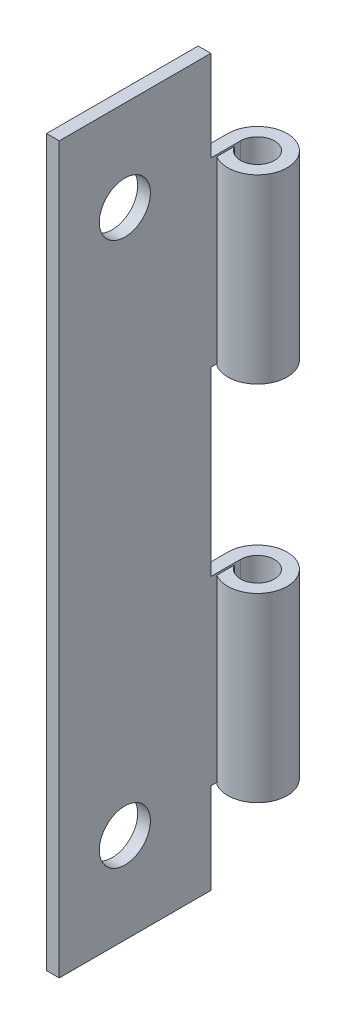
ISO-10303-21;
HEADER;
FILE_DESCRIPTION(('STEP AP214'),'2;1');
FILE_NAME('part.step','',(''),(''),'','','');
FILE_SCHEMA(('AUTOMOTIVE_DESIGN { 1 0 10303 214 1 1 1 1 }'));
ENDSEC;
DATA;
#1=APPLICATION_CONTEXT('core data for automotive mechanical design processes');
#2=APPLICATION_PROTOCOL_DEFINITION('international standard','automotive_design',2000,#1);
#3=PRODUCT_CONTEXT('',#1,'mechanical');
#4=PRODUCT('Part','Part','',(#3));
#5=PRODUCT_RELATED_PRODUCT_CATEGORY('part','',(#4));
#6=PRODUCT_DEFINITION_FORMATION('','',#4);
#7=PRODUCT_DEFINITION_CONTEXT('part definition',#1,'design');
#8=PRODUCT_DEFINITION('design','',#6,#7);
#9=PRODUCT_DEFINITION_SHAPE('','',#8);
#10=(LENGTH_UNIT() NAMED_UNIT(*) SI_UNIT(.MILLI.,.METRE.));
#11=(NAMED_UNIT(*) PLANE_ANGLE_UNIT() SI_UNIT($,.RADIAN.));
#12=(NAMED_UNIT(*) SI_UNIT($,.STERADIAN.) SOLID_ANGLE_UNIT());
#13=UNCERTAINTY_MEASURE_WITH_UNIT(LENGTH_MEASURE(1.E-05),#10,'distance_accuracy_value','');
#14=(GEOMETRIC_REPRESENTATION_CONTEXT(3) GLOBAL_UNCERTAINTY_ASSIGNED_CONTEXT((#13)) GLOBAL_UNIT_ASSIGNED_CONTEXT((#10,
#11,#12)) REPRESENTATION_CONTEXT('',''));
#15=CARTESIAN_POINT('',(0.,0.,0.));
#16=DIRECTION('',(0.,0.,1.));
#17=DIRECTION('',(1.,0.,0.));
#18=AXIS2_PLACEMENT_3D('',#15,#16,#17);
#19=CARTESIAN_POINT('',(2.079625,50.8,0.));
#20=DIRECTION('',(0.,-1.,0.));
#21=DIRECTION('',(0.,0.,-1.));
#22=AXIS2_PLACEMENT_3D('',#19,#20,#21);
#23=CYLINDRICAL_SURFACE('',#22,2.079625);
#24=CARTESIAN_POINT('',(2.079625,44.45,0.));
#25=DIRECTION('',(0.,1.,0.));
#26=DIRECTION('',(0.,0.,1.));
#27=AXIS2_PLACEMENT_3D('',#24,#25,#26);
#28=CIRCLE('',#27,2.079625);
#29=CARTESIAN_POINT('',(1.016,44.45,1.78704840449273));
#30=VERTEX_POINT('',#29);
#31=CARTESIAN_POINT('',(0.,44.45,0.));
#32=VERTEX_POINT('',#31);
#33=EDGE_CURVE('E158',#30,#32,#28,.T.);
#34=ORIENTED_EDGE('',*,*,#33,.F.);
#35=DIRECTION('',(0.,-1.,0.));
#36=VECTOR('',#35,1.);
#37=CARTESIAN_POINT('',(1.016,50.8,1.78704840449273));
#38=LINE('',#37,#36);
#39=CARTESIAN_POINT('',(1.016,31.75,1.78704840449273));
#40=VERTEX_POINT('',#39);
#41=EDGE_CURVE('E234',#30,#40,#38,.T.);
#42=ORIENTED_EDGE('',*,*,#41,.T.);
#43=CARTESIAN_POINT('',(2.079625,31.75,0.));
#44=DIRECTION('',(0.,-1.,0.));
#45=DIRECTION('',(0.,0.,-1.));
#46=AXIS2_PLACEMENT_3D('',#43,#44,#45);
#47=CIRCLE('',#46,2.079625);
#48=CARTESIAN_POINT('',(0.,31.75,0.));
#49=VERTEX_POINT('',#48);
#50=EDGE_CURVE('E50',#49,#40,#47,.T.);
#51=ORIENTED_EDGE('',*,*,#50,.F.);
#52=DIRECTION('',(0.,-1.,0.));
#53=VECTOR('',#52,1.);
#54=CARTESIAN_POINT('',(0.,50.8,0.));
#55=LINE('',#54,#53);
#56=EDGE_CURVE('E252',#32,#49,#55,.T.);
#57=ORIENTED_EDGE('',*,*,#56,.F.);
#58=EDGE_LOOP('',(#34,#42,#51,#57));
#59=FACE_BOUND('',#58,.T.);
#60=ADVANCED_FACE('F36',(#59),#23,.T.);
#61=CARTESIAN_POINT('',(1.016,19.05,1.78704840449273));
#62=VERTEX_POINT('',#61);
#63=CARTESIAN_POINT('',(1.016,6.35,1.78704840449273));
#64=VERTEX_POINT('',#63);
#65=EDGE_CURVE('E226',#62,#64,#38,.T.);
#66=ORIENTED_EDGE('',*,*,#65,.T.);
#67=CARTESIAN_POINT('',(2.079625,6.35,0.));
#68=DIRECTION('',(0.,-1.,0.));
#69=DIRECTION('',(0.,0.,-1.));
#70=AXIS2_PLACEMENT_3D('',#67,#68,#69);
#71=CIRCLE('',#70,2.079625);
#72=CARTESIAN_POINT('',(0.,6.35,0.));
#73=VERTEX_POINT('',#72);
#74=EDGE_CURVE('E211',#73,#64,#71,.T.);
#75=ORIENTED_EDGE('',*,*,#74,.F.);
#76=CARTESIAN_POINT('',(0.,19.05,0.));
#77=VERTEX_POINT('',#76);
#78=EDGE_CURVE('E249',#77,#73,#55,.T.);
#79=ORIENTED_EDGE('',*,*,#78,.F.);
#80=CARTESIAN_POINT('',(2.079625,19.05,0.));
#81=DIRECTION('',(0.,1.,0.));
#82=DIRECTION('',(0.,0.,1.));
#83=AXIS2_PLACEMENT_3D('',#80,#81,#82);
#84=CIRCLE('',#83,2.079625);
#85=EDGE_CURVE('E205',#62,#77,#84,.T.);
#86=ORIENTED_EDGE('',*,*,#85,.F.);
#87=EDGE_LOOP('',(#66,#75,#79,#86));
#88=FACE_BOUND('',#87,.T.);
#89=ADVANCED_FACE('F287',(#88),#23,.T.);
#90=CARTESIAN_POINT('',(0.,50.8,0.));
#91=DIRECTION('',(1.,0.,0.));
#92=DIRECTION('',(0.,0.,-1.));
#93=AXIS2_PLACEMENT_3D('',#90,#91,#92);
#94=PLANE('',#93);
#95=CARTESIAN_POINT('',(0.,44.45,8.1026));
#96=DIRECTION('',(-1.,0.,0.));
#97=DIRECTION('',(0.,0.,-1.));
#98=AXIS2_PLACEMENT_3D('',#95,#96,#97);
#99=CIRCLE('',#98,1.7907);
#100=CARTESIAN_POINT('',(0.,44.45,6.3119));
#101=VERTEX_POINT('',#100);
#102=EDGE_CURVE('E468',#101,#101,#99,.T.);
#103=ORIENTED_EDGE('',*,*,#102,.F.);
#104=EDGE_LOOP('',(#103));
#105=FACE_BOUND('',#104,.T.);
#106=CARTESIAN_POINT('',(0.,6.35,8.1026));
#107=DIRECTION('',(1.,0.,0.));
#108=DIRECTION('',(0.,0.,-1.));
#109=AXIS2_PLACEMENT_3D('',#106,#107,#108);
#110=CIRCLE('',#109,1.7907);
#111=CARTESIAN_POINT('',(0.,6.35,6.3119));
#112=VERTEX_POINT('',#111);
#113=EDGE_CURVE('E185',#112,#112,#110,.T.);
#114=ORIENTED_EDGE('',*,*,#113,.T.);
#115=EDGE_LOOP('',(#114));
#116=FACE_BOUND('',#115,.T.);
#117=DIRECTION('',(0.,-1.,0.));
#118=VECTOR('',#117,1.);
#119=CARTESIAN_POINT('',(0.,50.8,2.079625));
#120=LINE('',#119,#118);
#121=CARTESIAN_POINT('',(0.,50.8,2.079625));
#122=VERTEX_POINT('',#121);
#123=CARTESIAN_POINT('',(0.,44.45,2.079625));
#124=VERTEX_POINT('',#123);
#125=EDGE_CURVE('E58',#122,#124,#120,.T.);
#126=ORIENTED_EDGE('',*,*,#125,.T.);
#127=DIRECTION('',(0.,0.,-1.));
#128=VECTOR('',#127,1.);
#129=CARTESIAN_POINT('',(0.,44.45,2.079625));
#130=LINE('',#129,#128);
#131=EDGE_CURVE('E153',#124,#32,#130,.T.);
#132=ORIENTED_EDGE('',*,*,#131,.T.);
#133=ORIENTED_EDGE('',*,*,#56,.T.);
#134=DIRECTION('',(0.,0.,1.));
#135=VECTOR('',#134,1.);
#136=CARTESIAN_POINT('',(0.,31.75,2.079625));
#137=LINE('',#136,#135);
#138=CARTESIAN_POINT('',(0.,31.75,2.079625));
#139=VERTEX_POINT('',#138);
#140=EDGE_CURVE('E188',#49,#139,#137,.T.);
#141=ORIENTED_EDGE('',*,*,#140,.T.);
#142=DIRECTION('',(0.,-1.,0.));
#143=VECTOR('',#142,1.);
#144=CARTESIAN_POINT('',(0.,31.75,2.079625));
#145=LINE('',#144,#143);
#146=CARTESIAN_POINT('',(0.,19.05,2.079625));
#147=VERTEX_POINT('',#146);
#148=EDGE_CURVE('E181',#139,#147,#145,.T.);
#149=ORIENTED_EDGE('',*,*,#148,.T.);
#150=DIRECTION('',(0.,0.,-1.));
#151=VECTOR('',#150,1.);
#152=CARTESIAN_POINT('',(0.,19.05,2.079625));
#153=LINE('',#152,#151);
#154=EDGE_CURVE('E184',#147,#77,#153,.T.);
#155=ORIENTED_EDGE('',*,*,#154,.T.);
#156=ORIENTED_EDGE('',*,*,#78,.T.);
#157=DIRECTION('',(0.,0.,1.));
#158=VECTOR('',#157,1.);
#159=CARTESIAN_POINT('',(0.,6.35,2.079625));
#160=LINE('',#159,#158);
#161=CARTESIAN_POINT('',(0.,6.35,2.079625));
#162=VERTEX_POINT('',#161);
#163=EDGE_CURVE('E169',#73,#162,#160,.T.);
#164=ORIENTED_EDGE('',*,*,#163,.T.);
#165=DIRECTION('',(0.,-1.,0.));
#166=VECTOR('',#165,1.);
#167=CARTESIAN_POINT('',(0.,0.,2.079625));
#168=LINE('',#167,#166);
#169=CARTESIAN_POINT('',(0.,0.,2.079625));
#170=VERTEX_POINT('',#169);
#171=EDGE_CURVE('E175',#162,#170,#168,.T.);
#172=ORIENTED_EDGE('',*,*,#171,.T.);
#173=DIRECTION('',(0.,0.,1.));
#174=VECTOR('',#173,1.);
#175=CARTESIAN_POINT('',(0.,0.,0.));
#176=LINE('',#175,#174);
#177=CARTESIAN_POINT('',(0.,0.,12.7));
#178=VERTEX_POINT('',#177);
#179=EDGE_CURVE('E218',#170,#178,#176,.T.);
#180=ORIENTED_EDGE('',*,*,#179,.T.);
#181=DIRECTION('',(0.,-1.,0.));
#182=VECTOR('',#181,1.);
#183=CARTESIAN_POINT('',(0.,50.8,12.7));
#184=LINE('',#183,#182);
#185=CARTESIAN_POINT('',(0.,50.8,12.7));
#186=VERTEX_POINT('',#185);
#187=EDGE_CURVE('E246',#186,#178,#184,.T.);
#188=ORIENTED_EDGE('',*,*,#187,.F.);
#189=DIRECTION('',(0.,0.,1.));
#190=VECTOR('',#189,1.);
#191=CARTESIAN_POINT('',(0.,50.8,0.));
#192=LINE('',#191,#190);
#193=EDGE_CURVE('E166',#122,#186,#192,.T.);
#194=ORIENTED_EDGE('',*,*,#193,.F.);
#195=EDGE_LOOP('',(#126,#132,#133,#141,#149,#155,#156,#164,#172,#180,#188,#194));
#196=FACE_BOUND('',#195,.T.);
#197=ADVANCED_FACE('F164',(#105,#116,#196),#94,.F.);
#198=CARTESIAN_POINT('',(0.889,50.8,12.7));
#199=DIRECTION('',(-1.,0.,0.));
#200=DIRECTION('',(0.,0.,1.));
#201=AXIS2_PLACEMENT_3D('',#198,#199,#200);
#202=PLANE('',#201);
#203=CARTESIAN_POINT('',(0.889,44.45,8.1026));
#204=DIRECTION('',(-1.,0.,0.));
#205=DIRECTION('',(0.,0.,-1.));
#206=AXIS2_PLACEMENT_3D('',#203,#204,#205);
#207=CIRCLE('',#206,1.7907);
#208=CARTESIAN_POINT('',(0.889,44.45,6.3119));
#209=VERTEX_POINT('',#208);
#210=EDGE_CURVE('E471',#209,#209,#207,.T.);
#211=ORIENTED_EDGE('',*,*,#210,.T.);
#212=EDGE_LOOP('',(#211));
#213=FACE_BOUND('',#212,.T.);
#214=CARTESIAN_POINT('',(0.889,6.35,8.1026));
#215=DIRECTION('',(1.,0.,0.));
#216=DIRECTION('',(0.,0.,-1.));
#217=AXIS2_PLACEMENT_3D('',#214,#215,#216);
#218=CIRCLE('',#217,1.7907);
#219=CARTESIAN_POINT('',(0.889,6.35,6.3119));
#220=VERTEX_POINT('',#219);
#221=EDGE_CURVE('E172',#220,#220,#218,.T.);
#222=ORIENTED_EDGE('',*,*,#221,.F.);
#223=EDGE_LOOP('',(#222));
#224=FACE_BOUND('',#223,.T.);
#225=DIRECTION('',(0.,-1.,0.));
#226=VECTOR('',#225,1.);
#227=CARTESIAN_POINT('',(0.889,50.8,2.079625));
#228=LINE('',#227,#226);
#229=CARTESIAN_POINT('',(0.889,50.8,2.079625));
#230=VERTEX_POINT('',#229);
#231=CARTESIAN_POINT('',(0.889,44.45,2.079625));
#232=VERTEX_POINT('',#231);
#233=EDGE_CURVE('E149',#230,#232,#228,.T.);
#234=ORIENTED_EDGE('',*,*,#233,.F.);
#235=DIRECTION('',(0.,0.,-1.));
#236=VECTOR('',#235,1.);
#237=CARTESIAN_POINT('',(0.889,50.8,12.7));
#238=LINE('',#237,#236);
#239=CARTESIAN_POINT('',(0.889,50.8,12.7));
#240=VERTEX_POINT('',#239);
#241=EDGE_CURVE('E223',#240,#230,#238,.T.);
#242=ORIENTED_EDGE('',*,*,#241,.F.);
#243=DIRECTION('',(0.,-1.,0.));
#244=VECTOR('',#243,1.);
#245=CARTESIAN_POINT('',(0.889,50.8,12.7));
#246=LINE('',#245,#244);
#247=CARTESIAN_POINT('',(0.889,0.,12.7));
#248=VERTEX_POINT('',#247);
#249=EDGE_CURVE('E243',#240,#248,#246,.T.);
#250=ORIENTED_EDGE('',*,*,#249,.T.);
#251=DIRECTION('',(0.,0.,-1.));
#252=VECTOR('',#251,1.);
#253=CARTESIAN_POINT('',(0.889,0.,12.7));
#254=LINE('',#253,#252);
#255=CARTESIAN_POINT('',(0.889,0.,2.079625));
#256=VERTEX_POINT('',#255);
#257=EDGE_CURVE('E221',#248,#256,#254,.T.);
#258=ORIENTED_EDGE('',*,*,#257,.T.);
#259=DIRECTION('',(0.,-1.,0.));
#260=VECTOR('',#259,1.);
#261=CARTESIAN_POINT('',(0.889,50.8,2.079625));
#262=LINE('',#261,#260);
#263=CARTESIAN_POINT('',(0.889,6.35,2.079625));
#264=VERTEX_POINT('',#263);
#265=EDGE_CURVE('E152',#264,#256,#262,.T.);
#266=ORIENTED_EDGE('',*,*,#265,.F.);
#267=DIRECTION('',(0.,0.,1.));
#268=VECTOR('',#267,1.);
#269=CARTESIAN_POINT('',(0.889,6.35,12.7));
#270=LINE('',#269,#268);
#271=CARTESIAN_POINT('',(0.889,6.35,0.));
#272=VERTEX_POINT('',#271);
#273=EDGE_CURVE('E209',#272,#264,#270,.T.);
#274=ORIENTED_EDGE('',*,*,#273,.F.);
#275=DIRECTION('',(0.,-1.,0.));
#276=VECTOR('',#275,1.);
#277=CARTESIAN_POINT('',(0.889,50.8,0.));
#278=LINE('',#277,#276);
#279=CARTESIAN_POINT('',(0.889,19.05,0.));
#280=VERTEX_POINT('',#279);
#281=EDGE_CURVE('E239',#280,#272,#278,.T.);
#282=ORIENTED_EDGE('',*,*,#281,.F.);
#283=DIRECTION('',(0.,0.,-1.));
#284=VECTOR('',#283,1.);
#285=CARTESIAN_POINT('',(0.889,19.05,12.7));
#286=LINE('',#285,#284);
#287=CARTESIAN_POINT('',(0.889,19.05,2.079625));
#288=VERTEX_POINT('',#287);
#289=EDGE_CURVE('E203',#288,#280,#286,.T.);
#290=ORIENTED_EDGE('',*,*,#289,.F.);
#291=DIRECTION('',(0.,-1.,0.));
#292=VECTOR('',#291,1.);
#293=CARTESIAN_POINT('',(0.889,50.8,2.079625));
#294=LINE('',#293,#292);
#295=CARTESIAN_POINT('',(0.889,31.75,2.079625));
#296=VERTEX_POINT('',#295);
#297=EDGE_CURVE('E11',#296,#288,#294,.T.);
#298=ORIENTED_EDGE('',*,*,#297,.F.);
#299=DIRECTION('',(0.,0.,1.));
#300=VECTOR('',#299,1.);
#301=CARTESIAN_POINT('',(0.889,31.75,12.7));
#302=LINE('',#301,#300);
#303=CARTESIAN_POINT('',(0.889,31.75,0.));
#304=VERTEX_POINT('',#303);
#305=EDGE_CURVE('E198',#304,#296,#302,.T.);
#306=ORIENTED_EDGE('',*,*,#305,.F.);
#307=CARTESIAN_POINT('',(0.889,44.45,0.));
#308=VERTEX_POINT('',#307);
#309=EDGE_CURVE('E242',#308,#304,#278,.T.);
#310=ORIENTED_EDGE('',*,*,#309,.F.);
#311=DIRECTION('',(0.,0.,-1.));
#312=VECTOR('',#311,1.);
#313=CARTESIAN_POINT('',(0.889,44.45,12.7));
#314=LINE('',#313,#312);
#315=EDGE_CURVE('E215',#232,#308,#314,.T.);
#316=ORIENTED_EDGE('',*,*,#315,.F.);
#317=EDGE_LOOP('',(#234,#242,#250,#258,#266,#274,#282,#290,#298,#306,#310,#316));
#318=FACE_BOUND('',#317,.T.);
#319=ADVANCED_FACE('F305',(#213,#224,#318),#202,.F.);
#320=CARTESIAN_POINT('',(2.079625,50.8,0.));
#321=DIRECTION('',(0.,-1.,0.));
#322=DIRECTION('',(0.,0.,-1.));
#323=AXIS2_PLACEMENT_3D('',#320,#321,#322);
#324=CYLINDRICAL_SURFACE('',#323,1.190625);
#325=CARTESIAN_POINT('',(2.079625,44.45,0.));
#326=DIRECTION('',(0.,1.,0.));
#327=DIRECTION('',(0.,0.,1.));
#328=AXIS2_PLACEMENT_3D('',#325,#326,#327);
#329=CIRCLE('',#328,1.190625);
#330=CARTESIAN_POINT('',(1.016,44.45,0.535060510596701));
#331=VERTEX_POINT('',#330);
#332=EDGE_CURVE('E213',#308,#331,#329,.F.);
#333=ORIENTED_EDGE('',*,*,#332,.F.);
#334=ORIENTED_EDGE('',*,*,#309,.T.);
#335=CARTESIAN_POINT('',(2.079625,31.75,0.));
#336=DIRECTION('',(0.,-1.,0.));
#337=DIRECTION('',(0.,0.,-1.));
#338=AXIS2_PLACEMENT_3D('',#335,#336,#337);
#339=CIRCLE('',#338,1.190625);
#340=CARTESIAN_POINT('',(1.016,31.75,0.535060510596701));
#341=VERTEX_POINT('',#340);
#342=EDGE_CURVE('E196',#341,#304,#339,.F.);
#343=ORIENTED_EDGE('',*,*,#342,.F.);
#344=DIRECTION('',(0.,-1.,0.));
#345=VECTOR('',#344,1.);
#346=CARTESIAN_POINT('',(1.016,50.8,0.535060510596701));
#347=LINE('',#346,#345);
#348=EDGE_CURVE('E238',#331,#341,#347,.T.);
#349=ORIENTED_EDGE('',*,*,#348,.F.);
#350=EDGE_LOOP('',(#333,#334,#343,#349));
#351=FACE_BOUND('',#350,.T.);
#352=ADVANCED_FACE('F325',(#351),#324,.F.);
#353=CARTESIAN_POINT('',(2.079625,6.35,0.));
#354=DIRECTION('',(0.,-1.,0.));
#355=DIRECTION('',(0.,0.,-1.));
#356=AXIS2_PLACEMENT_3D('',#353,#354,#355);
#357=CIRCLE('',#356,1.190625);
#358=CARTESIAN_POINT('',(1.016,6.35,0.535060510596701));
#359=VERTEX_POINT('',#358);
#360=EDGE_CURVE('E207',#359,#272,#357,.F.);
#361=ORIENTED_EDGE('',*,*,#360,.F.);
#362=CARTESIAN_POINT('',(1.016,19.05,0.535060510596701));
#363=VERTEX_POINT('',#362);
#364=EDGE_CURVE('E235',#363,#359,#347,.T.);
#365=ORIENTED_EDGE('',*,*,#364,.F.);
#366=CARTESIAN_POINT('',(2.079625,19.05,0.));
#367=DIRECTION('',(0.,1.,0.));
#368=DIRECTION('',(0.,0.,1.));
#369=AXIS2_PLACEMENT_3D('',#366,#367,#368);
#370=CIRCLE('',#369,1.190625);
#371=EDGE_CURVE('E201',#280,#363,#370,.F.);
#372=ORIENTED_EDGE('',*,*,#371,.F.);
#373=ORIENTED_EDGE('',*,*,#281,.T.);
#374=EDGE_LOOP('',(#361,#365,#372,#373));
#375=FACE_BOUND('',#374,.T.);
#376=ADVANCED_FACE('F299',(#375),#324,.F.);
#377=CARTESIAN_POINT('',(1.016,50.8,0.535060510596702));
#378=DIRECTION('',(1.,0.,0.));
#379=DIRECTION('',(0.,0.,-1.));
#380=AXIS2_PLACEMENT_3D('',#377,#378,#379);
#381=PLANE('',#380);
#382=DIRECTION('',(0.,0.,1.));
#383=VECTOR('',#382,1.);
#384=CARTESIAN_POINT('',(1.016,44.45,0.535060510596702));
#385=LINE('',#384,#383);
#386=EDGE_CURVE('E43',#331,#30,#385,.T.);
#387=ORIENTED_EDGE('',*,*,#386,.F.);
#388=ORIENTED_EDGE('',*,*,#348,.T.);
#389=DIRECTION('',(0.,0.,-1.));
#390=VECTOR('',#389,1.);
#391=CARTESIAN_POINT('',(1.016,31.75,0.535060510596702));
#392=LINE('',#391,#390);
#393=EDGE_CURVE('E257',#40,#341,#392,.T.);
#394=ORIENTED_EDGE('',*,*,#393,.F.);
#395=ORIENTED_EDGE('',*,*,#41,.F.);
#396=EDGE_LOOP('',(#387,#388,#394,#395));
#397=FACE_BOUND('',#396,.T.);
#398=ADVANCED_FACE('F270',(#397),#381,.F.);
#399=DIRECTION('',(0.,0.,-1.));
#400=VECTOR('',#399,1.);
#401=CARTESIAN_POINT('',(1.016,6.35,0.535060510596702));
#402=LINE('',#401,#400);
#403=EDGE_CURVE('E262',#64,#359,#402,.T.);
#404=ORIENTED_EDGE('',*,*,#403,.F.);
#405=ORIENTED_EDGE('',*,*,#65,.F.);
#406=DIRECTION('',(0.,0.,1.));
#407=VECTOR('',#406,1.);
#408=CARTESIAN_POINT('',(1.016,19.05,0.535060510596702));
#409=LINE('',#408,#407);
#410=EDGE_CURVE('E259',#363,#62,#409,.T.);
#411=ORIENTED_EDGE('',*,*,#410,.F.);
#412=ORIENTED_EDGE('',*,*,#364,.T.);
#413=EDGE_LOOP('',(#404,#405,#411,#412));
#414=FACE_BOUND('',#413,.T.);
#415=ADVANCED_FACE('F294',(#414),#381,.F.);
#416=CARTESIAN_POINT('',(2.079625,50.8,0.));
#417=DIRECTION('',(0.,1.,0.));
#418=DIRECTION('',(0.,0.,1.));
#419=AXIS2_PLACEMENT_3D('',#416,#417,#418);
#420=PLANE('',#419);
#421=ORIENTED_EDGE('',*,*,#241,.T.);
#422=DIRECTION('',(-1.,0.,0.));
#423=VECTOR('',#422,1.);
#424=CARTESIAN_POINT('',(2.079625,50.8,2.079625));
#425=LINE('',#424,#423);
#426=EDGE_CURVE('E255',#230,#122,#425,.T.);
#427=ORIENTED_EDGE('',*,*,#426,.T.);
#428=ORIENTED_EDGE('',*,*,#193,.T.);
#429=DIRECTION('',(1.,0.,0.));
#430=VECTOR('',#429,1.);
#431=CARTESIAN_POINT('',(0.,50.8,12.7));
#432=LINE('',#431,#430);
#433=EDGE_CURVE('E220',#186,#240,#432,.T.);
#434=ORIENTED_EDGE('',*,*,#433,.T.);
#435=EDGE_LOOP('',(#421,#427,#428,#434));
#436=FACE_BOUND('',#435,.T.);
#437=ADVANCED_FACE('F321',(#436),#420,.T.);
#438=CARTESIAN_POINT('',(2.079625,0.,0.));
#439=DIRECTION('',(0.,1.,0.));
#440=DIRECTION('',(0.,0.,1.));
#441=AXIS2_PLACEMENT_3D('',#438,#439,#440);
#442=PLANE('',#441);
#443=DIRECTION('',(-1.,0.,0.));
#444=VECTOR('',#443,1.);
#445=CARTESIAN_POINT('',(2.079625,0.,2.079625));
#446=LINE('',#445,#444);
#447=EDGE_CURVE('E253',#256,#170,#446,.T.);
#448=ORIENTED_EDGE('',*,*,#447,.F.);
#449=ORIENTED_EDGE('',*,*,#257,.F.);
#450=DIRECTION('',(1.,0.,0.));
#451=VECTOR('',#450,1.);
#452=CARTESIAN_POINT('',(0.,0.,12.7));
#453=LINE('',#452,#451);
#454=EDGE_CURVE('E228',#178,#248,#453,.T.);
#455=ORIENTED_EDGE('',*,*,#454,.F.);
#456=ORIENTED_EDGE('',*,*,#179,.F.);
#457=EDGE_LOOP('',(#448,#449,#455,#456));
#458=FACE_BOUND('',#457,.T.);
#459=ADVANCED_FACE('F313',(#458),#442,.F.);
#460=CARTESIAN_POINT('',(0.,50.8,12.7));
#461=DIRECTION('',(0.,0.,-1.));
#462=DIRECTION('',(-1.,0.,0.));
#463=AXIS2_PLACEMENT_3D('',#460,#461,#462);
#464=PLANE('',#463);
#465=ORIENTED_EDGE('',*,*,#454,.T.);
#466=ORIENTED_EDGE('',*,*,#249,.F.);
#467=ORIENTED_EDGE('',*,*,#433,.F.);
#468=ORIENTED_EDGE('',*,*,#187,.T.);
#469=EDGE_LOOP('',(#465,#466,#467,#468));
#470=FACE_BOUND('',#469,.T.);
#471=ADVANCED_FACE('F317',(#470),#464,.F.);
#472=CARTESIAN_POINT('',(4.15925,6.35,2.079625));
#473=DIRECTION('',(0.,-1.,0.));
#474=DIRECTION('',(0.,0.,-1.));
#475=AXIS2_PLACEMENT_3D('',#472,#473,#474);
#476=PLANE('',#475);
#477=ORIENTED_EDGE('',*,*,#74,.T.);
#478=ORIENTED_EDGE('',*,*,#403,.T.);
#479=ORIENTED_EDGE('',*,*,#360,.T.);
#480=ORIENTED_EDGE('',*,*,#273,.T.);
#481=DIRECTION('',(-1.,0.,0.));
#482=VECTOR('',#481,1.);
#483=CARTESIAN_POINT('',(4.15925,6.35,2.079625));
#484=LINE('',#483,#482);
#485=EDGE_CURVE('E167',#264,#162,#484,.T.);
#486=ORIENTED_EDGE('',*,*,#485,.T.);
#487=ORIENTED_EDGE('',*,*,#163,.F.);
#488=EDGE_LOOP('',(#477,#478,#479,#480,#486,#487));
#489=FACE_BOUND('',#488,.T.);
#490=ADVANCED_FACE('F291',(#489),#476,.T.);
#491=CARTESIAN_POINT('',(4.15925,0.,2.079625));
#492=DIRECTION('',(0.,0.,-1.));
#493=DIRECTION('',(-1.,0.,0.));
#494=AXIS2_PLACEMENT_3D('',#491,#492,#493);
#495=PLANE('',#494);
#496=ORIENTED_EDGE('',*,*,#265,.T.);
#497=ORIENTED_EDGE('',*,*,#447,.T.);
#498=ORIENTED_EDGE('',*,*,#171,.F.);
#499=ORIENTED_EDGE('',*,*,#485,.F.);
#500=EDGE_LOOP('',(#496,#497,#498,#499));
#501=FACE_BOUND('',#500,.T.);
#502=ADVANCED_FACE('F309',(#501),#495,.T.);
#503=CARTESIAN_POINT('',(4.15925,44.45,2.079625));
#504=DIRECTION('',(0.,1.,0.));
#505=DIRECTION('',(0.,0.,1.));
#506=AXIS2_PLACEMENT_3D('',#503,#504,#505);
#507=PLANE('',#506);
#508=ORIENTED_EDGE('',*,*,#33,.T.);
#509=ORIENTED_EDGE('',*,*,#131,.F.);
#510=DIRECTION('',(-1.,0.,0.));
#511=VECTOR('',#510,1.);
#512=CARTESIAN_POINT('',(4.15925,44.45,2.079625));
#513=LINE('',#512,#511);
#514=EDGE_CURVE('E145',#232,#124,#513,.T.);
#515=ORIENTED_EDGE('',*,*,#514,.F.);
#516=ORIENTED_EDGE('',*,*,#315,.T.);
#517=ORIENTED_EDGE('',*,*,#332,.T.);
#518=ORIENTED_EDGE('',*,*,#386,.T.);
#519=EDGE_LOOP('',(#508,#509,#515,#516,#517,#518));
#520=FACE_BOUND('',#519,.T.);
#521=ADVANCED_FACE('F156',(#520),#507,.T.);
#522=CARTESIAN_POINT('',(4.15925,50.8,2.079625));
#523=DIRECTION('',(0.,0.,-1.));
#524=DIRECTION('',(0.,1.,0.));
#525=AXIS2_PLACEMENT_3D('',#522,#523,#524);
#526=PLANE('',#525);
#527=ORIENTED_EDGE('',*,*,#233,.T.);
#528=ORIENTED_EDGE('',*,*,#514,.T.);
#529=ORIENTED_EDGE('',*,*,#125,.F.);
#530=ORIENTED_EDGE('',*,*,#426,.F.);
#531=EDGE_LOOP('',(#527,#528,#529,#530));
#532=FACE_BOUND('',#531,.T.);
#533=ADVANCED_FACE('F147',(#532),#526,.T.);
#534=CARTESIAN_POINT('',(4.15925,31.75,2.079625));
#535=DIRECTION('',(0.,0.,-1.));
#536=DIRECTION('',(0.,1.,0.));
#537=AXIS2_PLACEMENT_3D('',#534,#535,#536);
#538=PLANE('',#537);
#539=ORIENTED_EDGE('',*,*,#297,.T.);
#540=DIRECTION('',(-1.,0.,0.));
#541=VECTOR('',#540,1.);
#542=CARTESIAN_POINT('',(4.15925,19.05,2.079625));
#543=LINE('',#542,#541);
#544=EDGE_CURVE('E178',#288,#147,#543,.T.);
#545=ORIENTED_EDGE('',*,*,#544,.T.);
#546=ORIENTED_EDGE('',*,*,#148,.F.);
#547=DIRECTION('',(-1.,0.,0.));
#548=VECTOR('',#547,1.);
#549=CARTESIAN_POINT('',(4.15925,31.75,2.079625));
#550=LINE('',#549,#548);
#551=EDGE_CURVE('E191',#296,#139,#550,.T.);
#552=ORIENTED_EDGE('',*,*,#551,.F.);
#553=EDGE_LOOP('',(#539,#545,#546,#552));
#554=FACE_BOUND('',#553,.T.);
#555=ADVANCED_FACE('F278',(#554),#538,.T.);
#556=CARTESIAN_POINT('',(4.15925,19.05,2.079625));
#557=DIRECTION('',(0.,1.,0.));
#558=DIRECTION('',(0.,0.,1.));
#559=AXIS2_PLACEMENT_3D('',#556,#557,#558);
#560=PLANE('',#559);
#561=ORIENTED_EDGE('',*,*,#85,.T.);
#562=ORIENTED_EDGE('',*,*,#154,.F.);
#563=ORIENTED_EDGE('',*,*,#544,.F.);
#564=ORIENTED_EDGE('',*,*,#289,.T.);
#565=ORIENTED_EDGE('',*,*,#371,.T.);
#566=ORIENTED_EDGE('',*,*,#410,.T.);
#567=EDGE_LOOP('',(#561,#562,#563,#564,#565,#566));
#568=FACE_BOUND('',#567,.T.);
#569=ADVANCED_FACE('F283',(#568),#560,.T.);
#570=CARTESIAN_POINT('',(4.15925,31.75,2.079625));
#571=DIRECTION('',(0.,-1.,0.));
#572=DIRECTION('',(0.,0.,-1.));
#573=AXIS2_PLACEMENT_3D('',#570,#571,#572);
#574=PLANE('',#573);
#575=ORIENTED_EDGE('',*,*,#50,.T.);
#576=ORIENTED_EDGE('',*,*,#393,.T.);
#577=ORIENTED_EDGE('',*,*,#342,.T.);
#578=ORIENTED_EDGE('',*,*,#305,.T.);
#579=ORIENTED_EDGE('',*,*,#551,.T.);
#580=ORIENTED_EDGE('',*,*,#140,.F.);
#581=EDGE_LOOP('',(#575,#576,#577,#578,#579,#580));
#582=FACE_BOUND('',#581,.T.);
#583=ADVANCED_FACE('F273',(#582),#574,.T.);
#584=CARTESIAN_POINT('',(0.,6.35,8.1026));
#585=DIRECTION('',(1.,0.,0.));
#586=DIRECTION('',(0.,0.,-1.));
#587=AXIS2_PLACEMENT_3D('',#584,#585,#586);
#588=CYLINDRICAL_SURFACE('',#587,1.7907);
#589=ORIENTED_EDGE('',*,*,#113,.F.);
#590=EDGE_LOOP('',(#589));
#591=FACE_BOUND('',#590,.T.);
#592=ORIENTED_EDGE('',*,*,#221,.T.);
#593=EDGE_LOOP('',(#592));
#594=FACE_BOUND('',#593,.T.);
#595=ADVANCED_FACE('F431',(#591,#594),#588,.F.);
#596=CARTESIAN_POINT('',(0.,44.45,8.1026));
#597=DIRECTION('',(1.,0.,0.));
#598=DIRECTION('',(0.,0.,-1.));
#599=AXIS2_PLACEMENT_3D('',#596,#597,#598);
#600=CYLINDRICAL_SURFACE('',#599,1.7907);
#601=ORIENTED_EDGE('',*,*,#102,.T.);
#602=EDGE_LOOP('',(#601));
#603=FACE_BOUND('',#602,.T.);
#604=ORIENTED_EDGE('',*,*,#210,.F.);
#605=EDGE_LOOP('',(#604));
#606=FACE_BOUND('',#605,.T.);
#607=ADVANCED_FACE('F439',(#603,#606),#600,.F.);
#608=CLOSED_SHELL('',(#60,#89,#197,#319,#352,#376,#398,#415,#437,#459,#471,#490,#502,#521,#533,
#555,#569,#583,#595,#607));
#609=MANIFOLD_SOLID_BREP('B2',#608);
#610=ADVANCED_BREP_SHAPE_REPRESENTATION('',(#18,#609),#14);
#611=SHAPE_DEFINITION_REPRESENTATION(#9,#610);
ENDSEC;
END-ISO-10303-21;
